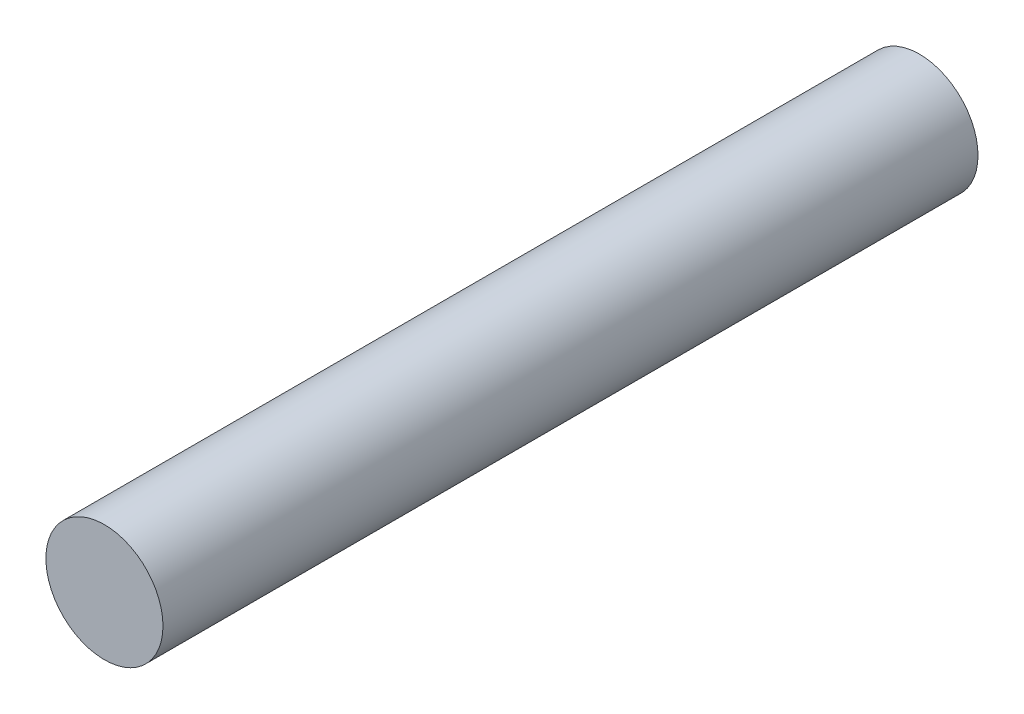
from build123d import *

# Parameters (mm, degrees)
SKETCH1_R           = 51
BOSS_EXTRUDE1_DEPTH = 355


with BuildPart() as part:
    # Sketch1 → Boss-Extrude1 (new, symmetric)
    with BuildSketch(Plane.XY):
        Circle(SKETCH1_R)
    extrude(amount=BOSS_EXTRUDE1_DEPTH, both=True)


solid = part.part
